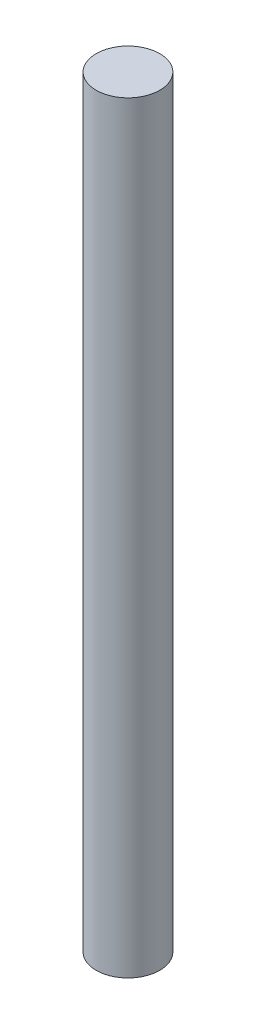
from build123d import *

# Parameters (mm, degrees)
SKETCH1_R      = 9.525
EXTRUDE1_DEPTH = 228.6


with BuildPart() as part:
    # Sketch1 → Extrude1 (new body)
    with BuildSketch(Plane(origin=(0, 0, 0), x_dir=(1, 0, 0), z_dir=(0, 1, 0))):
        with Locations(Location((0, 0, 0), (0, 0, 270))):
            Circle(SKETCH1_R)
    extrude(amount=EXTRUDE1_DEPTH)


solid = part.part
